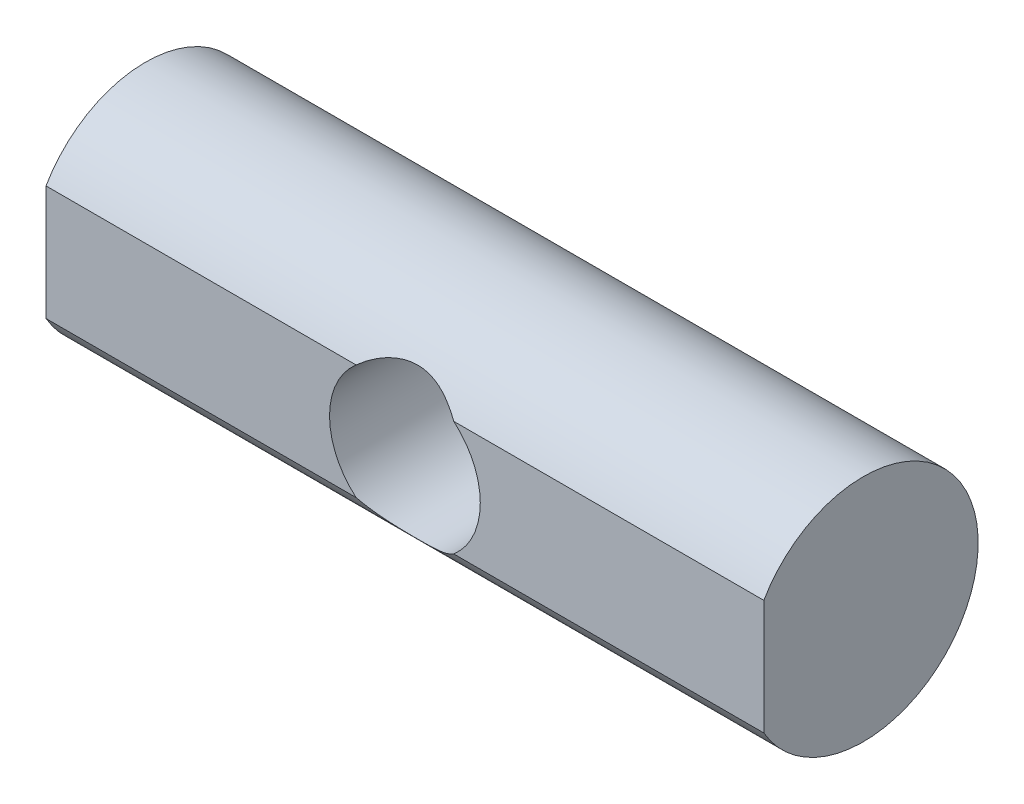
ISO-10303-21;
HEADER;
FILE_DESCRIPTION(('STEP AP214'),'2;1');
FILE_NAME('part.step','',(''),(''),'','','');
FILE_SCHEMA(('AUTOMOTIVE_DESIGN { 1 0 10303 214 1 1 1 1 }'));
ENDSEC;
DATA;
#1=APPLICATION_CONTEXT('core data for automotive mechanical design processes');
#2=APPLICATION_PROTOCOL_DEFINITION('international standard','automotive_design',2000,#1);
#3=PRODUCT_CONTEXT('',#1,'mechanical');
#4=PRODUCT('Part','Part','',(#3));
#5=PRODUCT_RELATED_PRODUCT_CATEGORY('part','',(#4));
#6=PRODUCT_DEFINITION_FORMATION('','',#4);
#7=PRODUCT_DEFINITION_CONTEXT('part definition',#1,'design');
#8=PRODUCT_DEFINITION('design','',#6,#7);
#9=PRODUCT_DEFINITION_SHAPE('','',#8);
#10=(LENGTH_UNIT() NAMED_UNIT(*) SI_UNIT(.MILLI.,.METRE.));
#11=(NAMED_UNIT(*) PLANE_ANGLE_UNIT() SI_UNIT($,.RADIAN.));
#12=(NAMED_UNIT(*) SI_UNIT($,.STERADIAN.) SOLID_ANGLE_UNIT());
#13=UNCERTAINTY_MEASURE_WITH_UNIT(LENGTH_MEASURE(1.E-05),#10,'distance_accuracy_value','');
#14=(GEOMETRIC_REPRESENTATION_CONTEXT(3) GLOBAL_UNCERTAINTY_ASSIGNED_CONTEXT((#13)) GLOBAL_UNIT_ASSIGNED_CONTEXT((#10,
#11,#12)) REPRESENTATION_CONTEXT('',''));
#15=CARTESIAN_POINT('',(0.,0.,0.));
#16=DIRECTION('',(0.,0.,1.));
#17=DIRECTION('',(1.,0.,0.));
#18=AXIS2_PLACEMENT_3D('',#15,#16,#17);
#19=CARTESIAN_POINT('',(25.,0.,6.92820323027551));
#20=DIRECTION('',(0.,0.,-1.));
#21=DIRECTION('',(-1.,0.,0.));
#22=AXIS2_PLACEMENT_3D('',#19,#20,#21);
#23=PLANE('',#22);
#24=CARTESIAN_POINT('',(0.,0.,6.92820323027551));
#25=DIRECTION('',(0.,0.,1.));
#26=DIRECTION('',(1.,0.,0.));
#27=AXIS2_PLACEMENT_3D('',#24,#25,#26);
#28=CIRCLE('',#27,5.24999999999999);
#29=CARTESIAN_POINT('',(3.40036762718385,-4.,6.92820323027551));
#30=VERTEX_POINT('',#29);
#31=CARTESIAN_POINT('',(3.40036762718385,4.,6.92820323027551));
#32=VERTEX_POINT('',#31);
#33=EDGE_CURVE('E137',#30,#32,#28,.T.);
#34=ORIENTED_EDGE('',*,*,#33,.F.);
#35=DIRECTION('',(-1.,0.,0.));
#36=VECTOR('',#35,1.);
#37=CARTESIAN_POINT('',(25.,-4.,6.92820323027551));
#38=LINE('',#37,#36);
#39=CARTESIAN_POINT('',(25.,-4.,6.92820323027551));
#40=VERTEX_POINT('',#39);
#41=EDGE_CURVE('E92',#40,#30,#38,.T.);
#42=ORIENTED_EDGE('',*,*,#41,.F.);
#43=DIRECTION('',(0.,-1.,0.));
#44=VECTOR('',#43,1.);
#45=CARTESIAN_POINT('',(25.,0.,6.92820323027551));
#46=LINE('',#45,#44);
#47=CARTESIAN_POINT('',(25.,4.,6.92820323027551));
#48=VERTEX_POINT('',#47);
#49=EDGE_CURVE('E71',#48,#40,#46,.T.);
#50=ORIENTED_EDGE('',*,*,#49,.F.);
#51=DIRECTION('',(-1.,0.,0.));
#52=VECTOR('',#51,1.);
#53=CARTESIAN_POINT('',(25.,4.,6.92820323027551));
#54=LINE('',#53,#52);
#55=EDGE_CURVE('E109',#48,#32,#54,.T.);
#56=ORIENTED_EDGE('',*,*,#55,.T.);
#57=EDGE_LOOP('',(#34,#42,#50,#56));
#58=FACE_BOUND('',#57,.T.);
#59=ADVANCED_FACE('F45',(#58),#23,.F.);
#60=CARTESIAN_POINT('',(-3.40036762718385,4.,6.92820323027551));
#61=VERTEX_POINT('',#60);
#62=CARTESIAN_POINT('',(-3.40036762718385,-4.,6.92820323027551));
#63=VERTEX_POINT('',#62);
#64=EDGE_CURVE('E64',#61,#63,#28,.T.);
#65=ORIENTED_EDGE('',*,*,#64,.F.);
#66=CARTESIAN_POINT('',(-25.,4.,6.92820323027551));
#67=VERTEX_POINT('',#66);
#68=EDGE_CURVE('E97',#61,#67,#54,.T.);
#69=ORIENTED_EDGE('',*,*,#68,.T.);
#70=DIRECTION('',(0.,-1.,0.));
#71=VECTOR('',#70,1.);
#72=CARTESIAN_POINT('',(-25.,0.,6.92820323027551));
#73=LINE('',#72,#71);
#74=CARTESIAN_POINT('',(-25.,-4.,6.92820323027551));
#75=VERTEX_POINT('',#74);
#76=EDGE_CURVE('E95',#67,#75,#73,.T.);
#77=ORIENTED_EDGE('',*,*,#76,.T.);
#78=EDGE_CURVE('E84',#63,#75,#38,.T.);
#79=ORIENTED_EDGE('',*,*,#78,.F.);
#80=EDGE_LOOP('',(#65,#69,#77,#79));
#81=FACE_BOUND('',#80,.T.);
#82=ADVANCED_FACE('F96',(#81),#23,.F.);
#83=CARTESIAN_POINT('',(25.,0.,0.));
#84=DIRECTION('',(-1.,0.,0.));
#85=DIRECTION('',(0.,0.,1.));
#86=AXIS2_PLACEMENT_3D('',#83,#84,#85);
#87=CYLINDRICAL_SURFACE('',#86,8.);
#88=CARTESIAN_POINT('',(5.24999999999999,0.,-8.));
#89=CARTESIAN_POINT('',(5.24999941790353,-0.132286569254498,-7.99999945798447));
#90=CARTESIAN_POINT('',(5.24499296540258,-0.264582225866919,-7.99671141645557));
#91=CARTESIAN_POINT('',(5.22504291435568,-0.528102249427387,-7.98364062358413));
#92=CARTESIAN_POINT('',(5.21009843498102,-0.65932652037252,-7.97385729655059));
#93=CARTESIAN_POINT('',(5.17048960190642,-0.919721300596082,-7.94803354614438));
#94=CARTESIAN_POINT('',(5.14582159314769,-1.04889101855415,-7.93199076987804));
#95=CARTESIAN_POINT('',(5.08710353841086,-1.30424375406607,-7.89402441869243));
#96=CARTESIAN_POINT('',(5.05304963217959,-1.43042551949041,-7.87209842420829));
#97=CARTESIAN_POINT('',(4.97619909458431,-1.67829937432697,-7.8229909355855));
#98=CARTESIAN_POINT('',(4.93344876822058,-1.80001137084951,-7.79583731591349));
#99=CARTESIAN_POINT('',(4.83957833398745,-2.03899126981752,-7.73677543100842));
#100=CARTESIAN_POINT('',(4.78845497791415,-2.15625742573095,-7.70486532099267));
#101=CARTESIAN_POINT('',(4.62330575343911,-2.50044148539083,-7.60295338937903));
#102=CARTESIAN_POINT('',(4.49743133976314,-2.71996536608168,-7.52672458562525));
#103=CARTESIAN_POINT('',(4.20637334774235,-3.15321498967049,-7.35635717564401));
#104=CARTESIAN_POINT('',(4.03878197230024,-3.36491877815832,-7.2612537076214));
#105=CARTESIAN_POINT('',(3.6746084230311,-3.75923792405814,-7.0651691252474));
#106=CARTESIAN_POINT('',(3.47798551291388,-3.94181164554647,-6.96417987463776));
#107=CARTESIAN_POINT('',(3.1475616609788,-4.20466109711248,-6.80686544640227));
#108=CARTESIAN_POINT('',(3.02241988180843,-4.29551526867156,-6.74973748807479));
#109=CARTESIAN_POINT('',(2.76383704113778,-4.46628995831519,-6.63797214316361));
#110=CARTESIAN_POINT('',(2.63039418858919,-4.5462081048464,-6.58333529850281));
#111=CARTESIAN_POINT('',(2.21852959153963,-4.76840282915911,-6.42612646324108));
#112=CARTESIAN_POINT('',(1.92790573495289,-4.89365309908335,-6.32992065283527));
#113=CARTESIAN_POINT('',(1.40589410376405,-5.0634517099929,-6.19434338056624));
#114=CARTESIAN_POINT('',(1.18085352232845,-5.12079179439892,-6.14659680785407));
#115=CARTESIAN_POINT('',(0.836541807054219,-5.18424003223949,-6.09297752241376));
#116=CARTESIAN_POINT('',(0.720677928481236,-5.2016274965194,-6.07810609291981));
#117=CARTESIAN_POINT('',(0.487418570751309,-5.22864109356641,-6.0548860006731));
#118=CARTESIAN_POINT('',(0.370023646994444,-5.23826996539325,-6.04653503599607));
#119=CARTESIAN_POINT('',(0.134105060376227,-5.24962088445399,-6.03668247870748));
#120=CARTESIAN_POINT('',(0.0155787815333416,-5.25131196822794,-6.03520770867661));
#121=CARTESIAN_POINT('',(-0.221195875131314,-5.24667458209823,-6.0392396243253));
#122=CARTESIAN_POINT('',(-0.339444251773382,-5.24034607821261,-6.04474633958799));
#123=CARTESIAN_POINT('',(-0.5748010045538,-5.21977608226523,-6.06251777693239));
#124=CARTESIAN_POINT('',(-0.691908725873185,-5.20553028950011,-6.07478617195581));
#125=CARTESIAN_POINT('',(-0.924113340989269,-5.16936598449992,-6.10558850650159));
#126=CARTESIAN_POINT('',(-1.03920940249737,-5.14744437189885,-6.12412497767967));
#127=CARTESIAN_POINT('',(-1.37158379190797,-5.07261187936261,-6.18649784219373));
#128=CARTESIAN_POINT('',(-1.58529285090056,-5.00975896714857,-6.23790804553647));
#129=CARTESIAN_POINT('',(-1.9992565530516,-4.85943581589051,-6.35570121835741));
#130=CARTESIAN_POINT('',(-2.19950675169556,-4.77195749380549,-6.42208910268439));
#131=CARTESIAN_POINT('',(-2.6236004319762,-4.55485916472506,-6.57833675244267));
#132=CARTESIAN_POINT('',(-2.84416552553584,-4.42031159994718,-6.67023608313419));
#133=CARTESIAN_POINT('',(-3.2622106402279,-4.12147803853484,-6.85891133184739));
#134=CARTESIAN_POINT('',(-3.45966202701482,-3.9571557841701,-6.95569309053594));
#135=CARTESIAN_POINT('',(-3.75544585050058,-3.67191231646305,-7.10857846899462));
#136=CARTESIAN_POINT('',(-3.86193273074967,-3.55977359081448,-7.16553021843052));
#137=CARTESIAN_POINT('',(-4.06510833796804,-3.32586507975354,-7.27704504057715));
#138=CARTESIAN_POINT('',(-4.16180018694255,-3.20409838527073,-7.33160887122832));
#139=CARTESIAN_POINT('',(-4.34462870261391,-2.95144119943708,-7.43691618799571));
#140=CARTESIAN_POINT('',(-4.43077106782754,-2.82055569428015,-7.48766173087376));
#141=CARTESIAN_POINT('',(-4.59170037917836,-2.55019928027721,-7.58400012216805));
#142=CARTESIAN_POINT('',(-4.66649047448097,-2.41073076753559,-7.62959439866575));
#143=CARTESIAN_POINT('',(-4.79021611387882,-2.15234761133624,-7.70595852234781));
#144=CARTESIAN_POINT('',(-4.84134040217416,-2.03481604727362,-7.73787751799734));
#145=CARTESIAN_POINT('',(-4.93517828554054,-1.79528608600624,-7.79693235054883));
#146=CARTESIAN_POINT('',(-4.97789344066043,-1.67328852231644,-7.82406907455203));
#147=CARTESIAN_POINT('',(-5.05442044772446,-1.42553029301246,-7.8729791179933));
#148=CARTESIAN_POINT('',(-5.08823578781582,-1.29977112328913,-7.89475453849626));
#149=CARTESIAN_POINT('',(-5.14653959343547,-1.0453030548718,-7.93245706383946));
#150=CARTESIAN_POINT('',(-5.17103238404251,-0.916595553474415,-7.94838688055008));
#151=CARTESIAN_POINT('',(-5.21045188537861,-0.656549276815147,-7.97408829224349));
#152=CARTESIAN_POINT('',(-5.22533781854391,-0.525201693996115,-7.98383363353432));
#153=CARTESIAN_POINT('',(-5.24515421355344,-0.261434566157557,-7.99681727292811));
#154=CARTESIAN_POINT('',(-5.25008466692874,-0.129015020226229,-8.00005556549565));
#155=CARTESIAN_POINT('',(-5.24991313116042,0.135815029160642,-7.99994298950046));
#156=CARTESIAN_POINT('',(-5.24481110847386,0.268225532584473,-7.99659209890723));
#157=CARTESIAN_POINT('',(-5.22465474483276,0.531952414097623,-7.98338647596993));
#158=CARTESIAN_POINT('',(-5.20960075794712,0.663268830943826,-7.97353197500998));
#159=CARTESIAN_POINT('',(-5.17103513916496,0.915486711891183,-7.94839004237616));
#160=CARTESIAN_POINT('',(-5.14812310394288,1.036518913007,-7.93348852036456));
#161=CARTESIAN_POINT('',(-5.09406099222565,1.27598296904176,-7.8985149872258));
#162=CARTESIAN_POINT('',(-5.06290811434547,1.39441392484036,-7.87844121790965));
#163=CARTESIAN_POINT('',(-4.9576128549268,1.74467712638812,-7.81104774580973));
#164=CARTESIAN_POINT('',(-4.87160178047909,1.97168488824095,-7.75653445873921));
#165=CARTESIAN_POINT('',(-4.6646477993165,2.42265388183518,-7.628199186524));
#166=CARTESIAN_POINT('',(-4.54176532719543,2.64541292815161,-7.55333580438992));
#167=CARTESIAN_POINT('',(-4.26768447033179,3.06804437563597,-7.39177730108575));
#168=CARTESIAN_POINT('',(-4.11646673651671,3.26790098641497,-7.30507410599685));
#169=CARTESIAN_POINT('',(-3.76311045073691,3.67211224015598,-7.11148738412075));
#170=CARTESIAN_POINT('',(-3.55670629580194,3.87227333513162,-7.00356949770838));
#171=CARTESIAN_POINT('',(-3.22456623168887,4.14550971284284,-6.84295195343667));
#172=CARTESIAN_POINT('',(-3.11001678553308,4.23213435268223,-6.78958894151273));
#173=CARTESIAN_POINT('',(-2.87366921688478,4.39604632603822,-6.68462710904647));
#174=CARTESIAN_POINT('',(-2.75187109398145,4.47333365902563,-6.63302828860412));
#175=CARTESIAN_POINT('',(-2.4028302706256,4.67499256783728,-6.4937704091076));
#176=CARTESIAN_POINT('',(-2.16779101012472,4.7887661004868,-6.40955986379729));
#177=CARTESIAN_POINT('',(-1.80083370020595,4.93323336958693,-6.29816895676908));
#178=CARTESIAN_POINT('',(-1.6761520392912,4.97701496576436,-6.26353380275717));
#179=CARTESIAN_POINT('',(-1.42242327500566,5.05537413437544,-6.20046110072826));
#180=CARTESIAN_POINT('',(-1.29337885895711,5.08995726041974,-6.1720198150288));
#181=CARTESIAN_POINT('',(-1.05276451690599,5.14459574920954,-6.12651517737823));
#182=CARTESIAN_POINT('',(-0.941726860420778,5.16609375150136,-6.10835713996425));
#183=CARTESIAN_POINT('',(-0.717752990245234,5.20194013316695,-6.07785939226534));
#184=CARTESIAN_POINT('',(-0.604817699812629,5.21629189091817,-6.06551693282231));
#185=CARTESIAN_POINT('',(-0.37780585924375,5.23762847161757,-6.04710248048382));
#186=CARTESIAN_POINT('',(-0.263729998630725,5.24461750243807,-6.04102690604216));
#187=CARTESIAN_POINT('',(-0.0352007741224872,5.25112641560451,-6.03536989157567));
#188=CARTESIAN_POINT('',(0.0792525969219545,5.25064615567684,-6.0357885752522));
#189=CARTESIAN_POINT('',(0.307621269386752,5.24222421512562,-6.0431050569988));
#190=CARTESIAN_POINT('',(0.421536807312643,5.23428619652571,-6.04999967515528));
#191=CARTESIAN_POINT('',(0.648088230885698,5.21109088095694,-6.06998785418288));
#192=CARTESIAN_POINT('',(0.760723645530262,5.19583097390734,-6.08308362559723));
#193=CARTESIAN_POINT('',(1.09572742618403,5.13936816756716,-6.13102115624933));
#194=CARTESIAN_POINT('',(1.31513813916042,5.08748437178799,-6.17451100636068));
#195=CARTESIAN_POINT('',(1.80216087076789,4.93930502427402,-6.29400842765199));
#196=CARTESIAN_POINT('',(2.06577789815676,4.83458374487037,-6.37574202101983));
#197=CARTESIAN_POINT('',(2.44249471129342,4.64934336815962,-6.51071994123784));
#198=CARTESIAN_POINT('',(2.56507118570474,4.58281631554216,-6.55783313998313));
#199=CARTESIAN_POINT('',(2.80375885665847,4.44080069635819,-6.65482503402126));
#200=CARTESIAN_POINT('',(2.91987040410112,4.36531261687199,-6.70470357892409));
#201=CARTESIAN_POINT('',(3.26184250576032,4.12331191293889,-6.85820992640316));
#202=CARTESIAN_POINT('',(3.47734467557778,3.94323751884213,-6.96420110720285));
#203=CARTESIAN_POINT('',(3.77750355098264,3.64865068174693,-7.1203789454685));
#204=CARTESIAN_POINT('',(3.87374570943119,3.54632408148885,-7.17199275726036));
#205=CARTESIAN_POINT('',(4.05819961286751,3.33366453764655,-7.27327486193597));
#206=CARTESIAN_POINT('',(4.14640960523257,3.22332985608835,-7.322942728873));
#207=CARTESIAN_POINT('',(4.3240133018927,2.98168507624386,-7.42487067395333));
#208=CARTESIAN_POINT('',(4.41234115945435,2.8494304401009,-7.47675560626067));
#209=CARTESIAN_POINT('',(4.57732312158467,2.57605904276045,-7.57528956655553));
#210=CARTESIAN_POINT('',(4.65398293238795,2.43494666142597,-7.62194115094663));
#211=CARTESIAN_POINT('',(4.79460298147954,2.14481580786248,-7.70860925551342));
#212=CARTESIAN_POINT('',(4.85857999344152,1.99580811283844,-7.74863452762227));
#213=CARTESIAN_POINT('',(4.97292592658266,1.69085587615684,-7.82083908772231));
#214=CARTESIAN_POINT('',(5.02330079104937,1.53491439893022,-7.85302180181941));
#215=CARTESIAN_POINT('',(5.09655690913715,1.26524773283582,-7.90011806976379));
#216=CARTESIAN_POINT('',(5.12315138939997,1.15291329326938,-7.91731509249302));
#217=CARTESIAN_POINT('',(5.16895769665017,0.926146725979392,-7.94703202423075));
#218=CARTESIAN_POINT('',(5.18817084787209,0.811714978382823,-7.95955277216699));
#219=CARTESIAN_POINT('',(5.21899859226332,0.581419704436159,-7.97968107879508));
#220=CARTESIAN_POINT('',(5.2306142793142,0.46555638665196,-7.98728934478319));
#221=CARTESIAN_POINT('',(5.24611402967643,0.233130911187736,-7.99744825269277));
#222=CARTESIAN_POINT('',(5.25000051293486,0.116568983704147,-8.00000047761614));
#223=CARTESIAN_POINT('',(5.24999999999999,0.,-8.));
#224=B_SPLINE_CURVE_WITH_KNOTS('',3,(#88,#89,#90,#91,#92,#93,#94,#95,#96,#97,#98,#99,#100,#101,
#102,#103,#104,#105,#106,#107,#108,#109,#110,#111,#112,#113,#114,#115,#116,#117,#118,#119,#120,
#121,#122,#123,#124,#125,#126,#127,#128,#129,#130,#131,#132,#133,#134,#135,#136,#137,#138,#139,
#140,#141,#142,#143,#144,#145,#146,#147,#148,#149,#150,#151,#152,#153,#154,#155,#156,#157,#158,
#159,#160,#161,#162,#163,#164,#165,#166,#167,#168,#169,#170,#171,#172,#173,#174,#175,#176,#177,
#178,#179,#180,#181,#182,#183,#184,#185,#186,#187,#188,#189,#190,#191,#192,#193,#194,#195,#196,
#197,#198,#199,#200,#201,#202,#203,#204,#205,#206,#207,#208,#209,#210,#211,#212,#213,#214,#215,
#216,#217,#218,#219,#220,#221,#222,#223),.UNSPECIFIED.,.T.,.F.,(4,2,2,2,2,2,2,2,2,2,2,2,2,2,2,2,
2,2,2,2,2,2,2,2,2,2,2,2,2,2,2,2,2,2,2,2,2,2,2,2,2,2,2,2,2,2,2,2,2,2,2,2,2,2,2,2,2,2,2,2,2,2,2,2,
2,2,2,4),(0.,0.396741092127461,0.793517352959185,1.19044290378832,1.58753194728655,
1.98255953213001,2.37774072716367,3.16740455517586,4.02313974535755,4.88008729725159,
5.37412165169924,5.86826297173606,6.8538293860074,7.56203004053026,7.9159414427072,
8.26972784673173,8.62489314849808,8.98005995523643,9.33541987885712,9.69092350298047,
10.3740075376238,11.0573160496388,11.8771293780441,12.6979478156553,13.1918289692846,
13.6855522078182,14.1790075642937,14.6723257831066,15.068180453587,15.4639616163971,
15.8595874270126,16.2550294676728,16.6521391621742,17.0492491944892,17.4463605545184,
17.8434577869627,18.2152691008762,18.5872069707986,19.3304635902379,20.1230506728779,
20.9161809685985,21.8334710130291,22.2927035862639,22.7519361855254,23.5712503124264,
23.9806765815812,24.3898550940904,24.7331439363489,25.0762703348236,25.4192005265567,
25.7621372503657,26.1049056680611,26.4477963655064,27.133741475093,28.0143815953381,
28.4556565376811,28.8969075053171,29.7933860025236,30.2420309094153,30.6907734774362,
31.1919458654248,31.6928723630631,32.1931318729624,32.6931724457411,33.0429975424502,
33.3927598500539,33.7424717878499,34.0920742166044),.UNSPECIFIED.);
#225=CARTESIAN_POINT('',(5.24999999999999,0.,-8.));
#226=VERTEX_POINT('',#225);
#227=EDGE_CURVE('E102',#226,#226,#224,.T.);
#228=ORIENTED_EDGE('',*,*,#227,.F.);
#229=EDGE_LOOP('',(#228));
#230=FACE_BOUND('',#229,.T.);
#231=ORIENTED_EDGE('',*,*,#41,.T.);
#232=CARTESIAN_POINT('',(3.40036762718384,-4.,6.92820323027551));
#233=CARTESIAN_POINT('',(3.29450872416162,-4.0899703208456,6.87627041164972));
#234=CARTESIAN_POINT('',(3.18507385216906,-4.1757797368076,6.82437998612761));
#235=CARTESIAN_POINT('',(2.9592015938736,-4.33878891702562,6.72191547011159));
#236=CARTESIAN_POINT('',(2.84275725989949,-4.41597991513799,6.67134275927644));
#237=CARTESIAN_POINT('',(2.60215613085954,-4.56193294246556,6.57241356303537));
#238=CARTESIAN_POINT('',(2.47793954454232,-4.63061318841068,6.52408101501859));
#239=CARTESIAN_POINT('',(2.22318659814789,-4.75817869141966,6.43163536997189));
#240=CARTESIAN_POINT('',(2.09265288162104,-4.81706800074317,6.38752053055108));
#241=CARTESIAN_POINT('',(1.73834907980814,-4.95954189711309,6.27817641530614));
#242=CARTESIAN_POINT('',(1.50922960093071,-5.03422736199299,6.21791041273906));
#243=CARTESIAN_POINT('',(1.15662614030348,-5.1224401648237,6.14508267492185));
#244=CARTESIAN_POINT('',(1.0377736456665,-5.14785655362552,6.12375260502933));
#245=CARTESIAN_POINT('',(0.797642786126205,-5.1904821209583,6.0876663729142));
#246=CARTESIAN_POINT('',(0.676365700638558,-5.20769551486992,6.07290683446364));
#247=CARTESIAN_POINT('',(0.431296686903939,-5.23371650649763,6.05049677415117));
#248=CARTESIAN_POINT('',(0.307492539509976,-5.24245774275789,6.04290238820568));
#249=CARTESIAN_POINT('',(0.0593395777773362,-5.25113240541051,6.0353659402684));
#250=CARTESIAN_POINT('',(-0.0650092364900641,-5.25106583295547,6.03542387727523));
#251=CARTESIAN_POINT('',(-0.313225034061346,-5.24211951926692,6.04319612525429));
#252=CARTESIAN_POINT('',(-0.437091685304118,-5.23323451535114,6.05091500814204));
#253=CARTESIAN_POINT('',(-0.68318781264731,-5.20683128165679,6.07364791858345));
#254=CARTESIAN_POINT('',(-0.805417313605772,-5.18931318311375,6.08866183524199));
#255=CARTESIAN_POINT('',(-1.145755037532,-5.12828420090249,6.14031083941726));
#256=CARTESIAN_POINT('',(-1.36107432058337,-5.0752188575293,6.18460160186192));
#257=CARTESIAN_POINT('',(-1.77971676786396,-4.94403421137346,6.28995521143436));
#258=CARTESIAN_POINT('',(-1.98301830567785,-4.86587127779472,6.35104723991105));
#259=CARTESIAN_POINT('',(-2.4028450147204,-4.67431195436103,6.49360662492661));
#260=CARTESIAN_POINT('',(-2.61726507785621,-4.55752357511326,6.5767269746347));
#261=CARTESIAN_POINT('',(-2.92310181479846,-4.36262734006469,6.70623257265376));
#262=CARTESIAN_POINT('',(-3.02220026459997,-4.29455957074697,6.75009638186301));
#263=CARTESIAN_POINT('',(-3.2151936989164,-4.15203243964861,6.83868882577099));
#264=CARTESIAN_POINT('',(-3.30909137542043,-4.07757643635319,6.88341699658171));
#265=CARTESIAN_POINT('',(-3.40036762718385,-4.,6.92820323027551));
#266=B_SPLINE_CURVE_WITH_KNOTS('',3,(#232,#233,#234,#235,#236,#237,#238,#239,#240,#241,#242,
#243,#244,#245,#246,#247,#248,#249,#250,#251,#252,#253,#254,#255,#256,#257,#258,#259,#260,#261,
#262,#263,#264,#265),.UNSPECIFIED.,.F.,.F.,(4,2,2,2,2,2,2,2,2,2,2,2,2,2,2,2,4),(0.,
0.444866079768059,0.8901806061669,1.33948799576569,1.7886089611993,2.53026659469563,
2.90008075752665,3.26970467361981,3.64220095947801,4.01469719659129,4.38741586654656,
4.76012887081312,5.43567058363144,6.11239310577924,6.8834173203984,7.26712678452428,
7.65063574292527),.UNSPECIFIED.);
#267=EDGE_CURVE('E11',#30,#63,#266,.T.);
#268=ORIENTED_EDGE('',*,*,#267,.T.);
#269=ORIENTED_EDGE('',*,*,#78,.T.);
#270=CARTESIAN_POINT('',(-25.,0.,0.));
#271=DIRECTION('',(1.,0.,0.));
#272=DIRECTION('',(0.,0.,-1.));
#273=AXIS2_PLACEMENT_3D('',#270,#271,#272);
#274=CIRCLE('',#273,8.);
#275=EDGE_CURVE('E90',#75,#67,#274,.T.);
#276=ORIENTED_EDGE('',*,*,#275,.T.);
#277=ORIENTED_EDGE('',*,*,#68,.F.);
#278=CARTESIAN_POINT('',(-3.40036762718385,4.,6.92820323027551));
#279=CARTESIAN_POINT('',(-3.29450872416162,4.0899703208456,6.87627041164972));
#280=CARTESIAN_POINT('',(-3.18507385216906,4.1757797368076,6.82437998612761));
#281=CARTESIAN_POINT('',(-2.95920159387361,4.33878891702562,6.72191547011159));
#282=CARTESIAN_POINT('',(-2.84275725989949,4.41597991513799,6.67134275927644));
#283=CARTESIAN_POINT('',(-2.60215613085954,4.56193294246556,6.57241356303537));
#284=CARTESIAN_POINT('',(-2.47793954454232,4.63061318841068,6.5240810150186));
#285=CARTESIAN_POINT('',(-2.22318659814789,4.75817869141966,6.43163536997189));
#286=CARTESIAN_POINT('',(-2.09265288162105,4.81706800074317,6.38752053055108));
#287=CARTESIAN_POINT('',(-1.73834907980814,4.95954189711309,6.27817641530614));
#288=CARTESIAN_POINT('',(-1.50922960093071,5.03422736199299,6.21791041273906));
#289=CARTESIAN_POINT('',(-1.15662614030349,5.1224401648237,6.14508267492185));
#290=CARTESIAN_POINT('',(-1.0377736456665,5.14785655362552,6.12375260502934));
#291=CARTESIAN_POINT('',(-0.797642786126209,5.1904821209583,6.0876663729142));
#292=CARTESIAN_POINT('',(-0.676365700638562,5.20769551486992,6.07290683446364));
#293=CARTESIAN_POINT('',(-0.431296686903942,5.23371650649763,6.05049677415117));
#294=CARTESIAN_POINT('',(-0.30749253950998,5.24245774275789,6.04290238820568));
#295=CARTESIAN_POINT('',(-0.0593395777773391,5.25113240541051,6.0353659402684));
#296=CARTESIAN_POINT('',(0.0650092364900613,5.25106583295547,6.03542387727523));
#297=CARTESIAN_POINT('',(0.313225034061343,5.24211951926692,6.04319612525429));
#298=CARTESIAN_POINT('',(0.437091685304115,5.23323451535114,6.05091500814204));
#299=CARTESIAN_POINT('',(0.683187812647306,5.20683128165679,6.07364791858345));
#300=CARTESIAN_POINT('',(0.805417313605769,5.18931318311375,6.08866183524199));
#301=CARTESIAN_POINT('',(1.145755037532,5.12828420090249,6.14031083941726));
#302=CARTESIAN_POINT('',(1.36107432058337,5.0752188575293,6.18460160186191));
#303=CARTESIAN_POINT('',(1.77971676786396,4.94403421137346,6.28995521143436));
#304=CARTESIAN_POINT('',(1.98301830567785,4.86587127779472,6.35104723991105));
#305=CARTESIAN_POINT('',(2.4028450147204,4.67431195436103,6.49360662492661));
#306=CARTESIAN_POINT('',(2.61726507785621,4.55752357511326,6.5767269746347));
#307=CARTESIAN_POINT('',(2.92310181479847,4.36262734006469,6.70623257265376));
#308=CARTESIAN_POINT('',(3.02220026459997,4.29455957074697,6.75009638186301));
#309=CARTESIAN_POINT('',(3.2151936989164,4.1520324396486,6.83868882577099));
#310=CARTESIAN_POINT('',(3.30909137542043,4.07757643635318,6.88341699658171));
#311=CARTESIAN_POINT('',(3.40036762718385,4.,6.92820323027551));
#312=B_SPLINE_CURVE_WITH_KNOTS('',3,(#278,#279,#280,#281,#282,#283,#284,#285,#286,#287,#288,
#289,#290,#291,#292,#293,#294,#295,#296,#297,#298,#299,#300,#301,#302,#303,#304,#305,#306,#307,
#308,#309,#310,#311),.UNSPECIFIED.,.F.,.F.,(4,2,2,2,2,2,2,2,2,2,2,2,2,2,2,2,4),(0.,
0.444866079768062,0.890180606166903,1.3394879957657,1.78860896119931,2.53026659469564,
2.90008075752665,3.26970467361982,3.64220095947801,4.01469719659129,4.38741586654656,
4.76012887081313,5.43567058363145,6.11239310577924,6.88341732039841,7.26712678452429,
7.65063574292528),.UNSPECIFIED.);
#313=EDGE_CURVE('E57',#61,#32,#312,.T.);
#314=ORIENTED_EDGE('',*,*,#313,.T.);
#315=ORIENTED_EDGE('',*,*,#55,.F.);
#316=CARTESIAN_POINT('',(25.,0.,0.));
#317=DIRECTION('',(1.,0.,0.));
#318=DIRECTION('',(0.,0.,-1.));
#319=AXIS2_PLACEMENT_3D('',#316,#317,#318);
#320=CIRCLE('',#319,8.);
#321=EDGE_CURVE('E99',#40,#48,#320,.T.);
#322=ORIENTED_EDGE('',*,*,#321,.F.);
#323=EDGE_LOOP('',(#231,#268,#269,#276,#277,#314,#315,#322));
#324=FACE_BOUND('',#323,.T.);
#325=ADVANCED_FACE('F87',(#230,#324),#87,.T.);
#326=CARTESIAN_POINT('',(25.,0.,0.));
#327=DIRECTION('',(1.,0.,0.));
#328=DIRECTION('',(0.,0.,-1.));
#329=AXIS2_PLACEMENT_3D('',#326,#327,#328);
#330=PLANE('',#329);
#331=ORIENTED_EDGE('',*,*,#321,.T.);
#332=ORIENTED_EDGE('',*,*,#49,.T.);
#333=EDGE_LOOP('',(#331,#332));
#334=FACE_BOUND('',#333,.T.);
#335=ADVANCED_FACE('F119',(#334),#330,.T.);
#336=CARTESIAN_POINT('',(-25.,0.,0.));
#337=DIRECTION('',(1.,0.,0.));
#338=DIRECTION('',(0.,0.,-1.));
#339=AXIS2_PLACEMENT_3D('',#336,#337,#338);
#340=PLANE('',#339);
#341=ORIENTED_EDGE('',*,*,#275,.F.);
#342=ORIENTED_EDGE('',*,*,#76,.F.);
#343=EDGE_LOOP('',(#341,#342));
#344=FACE_BOUND('',#343,.T.);
#345=ADVANCED_FACE('F101',(#344),#340,.F.);
#346=CARTESIAN_POINT('',(0.,0.,6.92820323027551));
#347=DIRECTION('',(0.,0.,1.));
#348=DIRECTION('',(1.,0.,0.));
#349=AXIS2_PLACEMENT_3D('',#346,#347,#348);
#350=CYLINDRICAL_SURFACE('',#349,5.24999999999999);
#351=ORIENTED_EDGE('',*,*,#227,.T.);
#352=EDGE_LOOP('',(#351));
#353=FACE_BOUND('',#352,.T.);
#354=ORIENTED_EDGE('',*,*,#33,.T.);
#355=ORIENTED_EDGE('',*,*,#313,.F.);
#356=ORIENTED_EDGE('',*,*,#64,.T.);
#357=ORIENTED_EDGE('',*,*,#267,.F.);
#358=EDGE_LOOP('',(#354,#355,#356,#357));
#359=FACE_BOUND('',#358,.T.);
#360=ADVANCED_FACE('F127',(#353,#359),#350,.F.);
#361=CLOSED_SHELL('',(#59,#82,#325,#335,#345,#360));
#362=MANIFOLD_SOLID_BREP('B2',#361);
#363=ADVANCED_BREP_SHAPE_REPRESENTATION('',(#18,#362),#14);
#364=SHAPE_DEFINITION_REPRESENTATION(#9,#363);
ENDSEC;
END-ISO-10303-21;
